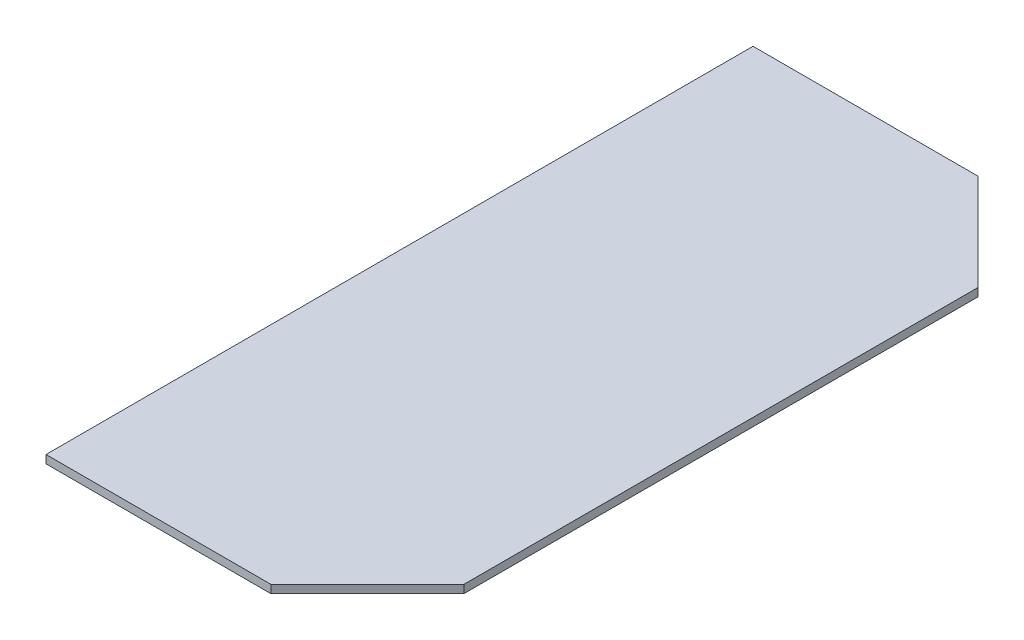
ISO-10303-21;
HEADER;
FILE_DESCRIPTION(('STEP AP214'),'2;1');
FILE_NAME('part.step','',(''),(''),'','','');
FILE_SCHEMA(('AUTOMOTIVE_DESIGN { 1 0 10303 214 1 1 1 1 }'));
ENDSEC;
DATA;
#1=APPLICATION_CONTEXT('core data for automotive mechanical design processes');
#2=APPLICATION_PROTOCOL_DEFINITION('international standard','automotive_design',2000,#1);
#3=PRODUCT_CONTEXT('',#1,'mechanical');
#4=PRODUCT('Part','Part','',(#3));
#5=PRODUCT_RELATED_PRODUCT_CATEGORY('part','',(#4));
#6=PRODUCT_DEFINITION_FORMATION('','',#4);
#7=PRODUCT_DEFINITION_CONTEXT('part definition',#1,'design');
#8=PRODUCT_DEFINITION('design','',#6,#7);
#9=PRODUCT_DEFINITION_SHAPE('','',#8);
#10=(LENGTH_UNIT() NAMED_UNIT(*) SI_UNIT(.MILLI.,.METRE.));
#11=(NAMED_UNIT(*) PLANE_ANGLE_UNIT() SI_UNIT($,.RADIAN.));
#12=(NAMED_UNIT(*) SI_UNIT($,.STERADIAN.) SOLID_ANGLE_UNIT());
#13=UNCERTAINTY_MEASURE_WITH_UNIT(LENGTH_MEASURE(1.E-05),#10,'distance_accuracy_value','');
#14=(GEOMETRIC_REPRESENTATION_CONTEXT(3) GLOBAL_UNCERTAINTY_ASSIGNED_CONTEXT((#13)) GLOBAL_UNIT_ASSIGNED_CONTEXT((#10,
#11,#12)) REPRESENTATION_CONTEXT('',''));
#15=CARTESIAN_POINT('',(0.,0.,0.));
#16=DIRECTION('',(0.,0.,1.));
#17=DIRECTION('',(1.,0.,0.));
#18=AXIS2_PLACEMENT_3D('',#15,#16,#17);
#19=CARTESIAN_POINT('',(0.,1.6002,-69.85));
#20=DIRECTION('',(0.,0.,1.));
#21=DIRECTION('',(1.,0.,0.));
#22=AXIS2_PLACEMENT_3D('',#19,#20,#21);
#23=PLANE('',#22);
#24=DIRECTION('',(-1.,0.,0.));
#25=VECTOR('',#24,1.);
#26=CARTESIAN_POINT('',(0.,0.,-69.85));
#27=LINE('',#26,#25);
#28=CARTESIAN_POINT('',(44.45,0.,-69.85));
#29=VERTEX_POINT('',#28);
#30=CARTESIAN_POINT('',(0.,0.,-69.85));
#31=VERTEX_POINT('',#30);
#32=EDGE_CURVE('E117',#29,#31,#27,.T.);
#33=ORIENTED_EDGE('',*,*,#32,.T.);
#34=DIRECTION('',(0.,-1.,0.));
#35=VECTOR('',#34,1.);
#36=CARTESIAN_POINT('',(0.,1.6002,-69.85));
#37=LINE('',#36,#35);
#38=CARTESIAN_POINT('',(0.,1.6002,-69.85));
#39=VERTEX_POINT('',#38);
#40=EDGE_CURVE('E11',#39,#31,#37,.T.);
#41=ORIENTED_EDGE('',*,*,#40,.F.);
#42=DIRECTION('',(-1.,0.,0.));
#43=VECTOR('',#42,1.);
#44=CARTESIAN_POINT('',(0.,1.6002,-69.85));
#45=LINE('',#44,#43);
#46=CARTESIAN_POINT('',(44.45,1.6002,-69.85));
#47=VERTEX_POINT('',#46);
#48=EDGE_CURVE('E127',#47,#39,#45,.T.);
#49=ORIENTED_EDGE('',*,*,#48,.F.);
#50=DIRECTION('',(0.,-1.,0.));
#51=VECTOR('',#50,1.);
#52=CARTESIAN_POINT('',(44.45,1.6002,-69.85));
#53=LINE('',#52,#51);
#54=EDGE_CURVE('E113',#47,#29,#53,.T.);
#55=ORIENTED_EDGE('',*,*,#54,.T.);
#56=EDGE_LOOP('',(#33,#41,#49,#55));
#57=FACE_BOUND('',#56,.T.);
#58=ADVANCED_FACE('F33',(#57),#23,.F.);
#59=CARTESIAN_POINT('',(0.,1.6002,-69.85));
#60=DIRECTION('',(1.,0.,0.));
#61=DIRECTION('',(0.,0.,-1.));
#62=AXIS2_PLACEMENT_3D('',#59,#60,#61);
#63=PLANE('',#62);
#64=DIRECTION('',(0.,0.,1.));
#65=VECTOR('',#64,1.);
#66=CARTESIAN_POINT('',(0.,0.,-69.85));
#67=LINE('',#66,#65);
#68=CARTESIAN_POINT('',(0.,0.,69.85));
#69=VERTEX_POINT('',#68);
#70=EDGE_CURVE('E120',#31,#69,#67,.T.);
#71=ORIENTED_EDGE('',*,*,#70,.T.);
#72=DIRECTION('',(0.,-1.,0.));
#73=VECTOR('',#72,1.);
#74=CARTESIAN_POINT('',(0.,1.6002,69.85));
#75=LINE('',#74,#73);
#76=CARTESIAN_POINT('',(0.,1.6002,69.85));
#77=VERTEX_POINT('',#76);
#78=EDGE_CURVE('E41',#77,#69,#75,.T.);
#79=ORIENTED_EDGE('',*,*,#78,.F.);
#80=DIRECTION('',(0.,0.,1.));
#81=VECTOR('',#80,1.);
#82=CARTESIAN_POINT('',(0.,1.6002,-69.85));
#83=LINE('',#82,#81);
#84=EDGE_CURVE('E86',#39,#77,#83,.T.);
#85=ORIENTED_EDGE('',*,*,#84,.F.);
#86=ORIENTED_EDGE('',*,*,#40,.T.);
#87=EDGE_LOOP('',(#71,#79,#85,#86));
#88=FACE_BOUND('',#87,.T.);
#89=ADVANCED_FACE('F151',(#88),#63,.F.);
#90=CARTESIAN_POINT('',(0.,1.6002,69.85));
#91=DIRECTION('',(0.,0.,-1.));
#92=DIRECTION('',(-1.,0.,0.));
#93=AXIS2_PLACEMENT_3D('',#90,#91,#92);
#94=PLANE('',#93);
#95=DIRECTION('',(1.,0.,0.));
#96=VECTOR('',#95,1.);
#97=CARTESIAN_POINT('',(0.,0.,69.85));
#98=LINE('',#97,#96);
#99=CARTESIAN_POINT('',(44.45,0.,69.85));
#100=VERTEX_POINT('',#99);
#101=EDGE_CURVE('E122',#69,#100,#98,.T.);
#102=ORIENTED_EDGE('',*,*,#101,.T.);
#103=DIRECTION('',(0.,-1.,0.));
#104=VECTOR('',#103,1.);
#105=CARTESIAN_POINT('',(44.45,1.6002,69.85));
#106=LINE('',#105,#104);
#107=CARTESIAN_POINT('',(44.45,1.6002,69.85));
#108=VERTEX_POINT('',#107);
#109=EDGE_CURVE('E108',#108,#100,#106,.T.);
#110=ORIENTED_EDGE('',*,*,#109,.F.);
#111=DIRECTION('',(1.,0.,0.));
#112=VECTOR('',#111,1.);
#113=CARTESIAN_POINT('',(0.,1.6002,69.85));
#114=LINE('',#113,#112);
#115=EDGE_CURVE('E99',#77,#108,#114,.T.);
#116=ORIENTED_EDGE('',*,*,#115,.F.);
#117=ORIENTED_EDGE('',*,*,#78,.T.);
#118=EDGE_LOOP('',(#102,#110,#116,#117));
#119=FACE_BOUND('',#118,.T.);
#120=ADVANCED_FACE('F133',(#119),#94,.F.);
#121=CARTESIAN_POINT('',(44.45,1.6002,69.85));
#122=DIRECTION('',(-0.707106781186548,0.,-0.707106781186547));
#123=DIRECTION('',(-0.707106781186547,0.,0.707106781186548));
#124=AXIS2_PLACEMENT_3D('',#121,#122,#123);
#125=PLANE('',#124);
#126=DIRECTION('',(0.707106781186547,0.,-0.707106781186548));
#127=VECTOR('',#126,1.);
#128=CARTESIAN_POINT('',(44.45,0.,69.85));
#129=LINE('',#128,#127);
#130=CARTESIAN_POINT('',(63.5,0.,50.8));
#131=VERTEX_POINT('',#130);
#132=EDGE_CURVE('E107',#100,#131,#129,.T.);
#133=ORIENTED_EDGE('',*,*,#132,.T.);
#134=DIRECTION('',(0.,-1.,0.));
#135=VECTOR('',#134,1.);
#136=CARTESIAN_POINT('',(63.5,1.6002,50.8));
#137=LINE('',#136,#135);
#138=CARTESIAN_POINT('',(63.5,1.6002,50.8));
#139=VERTEX_POINT('',#138);
#140=EDGE_CURVE('E104',#139,#131,#137,.T.);
#141=ORIENTED_EDGE('',*,*,#140,.F.);
#142=DIRECTION('',(0.707106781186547,0.,-0.707106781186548));
#143=VECTOR('',#142,1.);
#144=CARTESIAN_POINT('',(44.45,1.6002,69.85));
#145=LINE('',#144,#143);
#146=EDGE_CURVE('E93',#108,#139,#145,.T.);
#147=ORIENTED_EDGE('',*,*,#146,.F.);
#148=ORIENTED_EDGE('',*,*,#109,.T.);
#149=EDGE_LOOP('',(#133,#141,#147,#148));
#150=FACE_BOUND('',#149,.T.);
#151=ADVANCED_FACE('F105',(#150),#125,.F.);
#152=CARTESIAN_POINT('',(63.5,1.6002,-50.8));
#153=DIRECTION('',(-1.,0.,0.));
#154=DIRECTION('',(0.,0.,1.));
#155=AXIS2_PLACEMENT_3D('',#152,#153,#154);
#156=PLANE('',#155);
#157=DIRECTION('',(0.,0.,-1.));
#158=VECTOR('',#157,1.);
#159=CARTESIAN_POINT('',(63.5,0.,-50.8));
#160=LINE('',#159,#158);
#161=CARTESIAN_POINT('',(63.5,0.,-50.8));
#162=VERTEX_POINT('',#161);
#163=EDGE_CURVE('E72',#131,#162,#160,.T.);
#164=ORIENTED_EDGE('',*,*,#163,.T.);
#165=DIRECTION('',(0.,-1.,0.));
#166=VECTOR('',#165,1.);
#167=CARTESIAN_POINT('',(63.5,1.6002,-50.8));
#168=LINE('',#167,#166);
#169=CARTESIAN_POINT('',(63.5,1.6002,-50.8));
#170=VERTEX_POINT('',#169);
#171=EDGE_CURVE('E109',#170,#162,#168,.T.);
#172=ORIENTED_EDGE('',*,*,#171,.F.);
#173=DIRECTION('',(0.,0.,-1.));
#174=VECTOR('',#173,1.);
#175=CARTESIAN_POINT('',(63.5,1.6002,-50.8));
#176=LINE('',#175,#174);
#177=EDGE_CURVE('E97',#139,#170,#176,.T.);
#178=ORIENTED_EDGE('',*,*,#177,.F.);
#179=ORIENTED_EDGE('',*,*,#140,.T.);
#180=EDGE_LOOP('',(#164,#172,#178,#179));
#181=FACE_BOUND('',#180,.T.);
#182=ADVANCED_FACE('F111',(#181),#156,.F.);
#183=CARTESIAN_POINT('',(44.45,1.6002,-69.85));
#184=DIRECTION('',(-0.707106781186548,0.,0.707106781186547));
#185=DIRECTION('',(0.707106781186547,0.,0.707106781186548));
#186=AXIS2_PLACEMENT_3D('',#183,#184,#185);
#187=PLANE('',#186);
#188=DIRECTION('',(-0.707106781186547,0.,-0.707106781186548));
#189=VECTOR('',#188,1.);
#190=CARTESIAN_POINT('',(44.45,0.,-69.85));
#191=LINE('',#190,#189);
#192=EDGE_CURVE('E78',#162,#29,#191,.T.);
#193=ORIENTED_EDGE('',*,*,#192,.T.);
#194=ORIENTED_EDGE('',*,*,#54,.F.);
#195=DIRECTION('',(-0.707106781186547,0.,-0.707106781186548));
#196=VECTOR('',#195,1.);
#197=CARTESIAN_POINT('',(44.45,1.6002,-69.85));
#198=LINE('',#197,#196);
#199=EDGE_CURVE('E49',#170,#47,#198,.T.);
#200=ORIENTED_EDGE('',*,*,#199,.F.);
#201=ORIENTED_EDGE('',*,*,#171,.T.);
#202=EDGE_LOOP('',(#193,#194,#200,#201));
#203=FACE_BOUND('',#202,.T.);
#204=ADVANCED_FACE('F140',(#203),#187,.F.);
#205=CARTESIAN_POINT('',(0.,1.6002,0.));
#206=DIRECTION('',(0.,-1.,0.));
#207=DIRECTION('',(0.,0.,-1.));
#208=AXIS2_PLACEMENT_3D('',#205,#206,#207);
#209=PLANE('',#208);
#210=ORIENTED_EDGE('',*,*,#48,.T.);
#211=ORIENTED_EDGE('',*,*,#84,.T.);
#212=ORIENTED_EDGE('',*,*,#115,.T.);
#213=ORIENTED_EDGE('',*,*,#146,.T.);
#214=ORIENTED_EDGE('',*,*,#177,.T.);
#215=ORIENTED_EDGE('',*,*,#199,.T.);
#216=EDGE_LOOP('',(#210,#211,#212,#213,#214,#215));
#217=FACE_BOUND('',#216,.T.);
#218=ADVANCED_FACE('F95',(#217),#209,.F.);
#219=CARTESIAN_POINT('',(0.,0.,0.));
#220=DIRECTION('',(0.,-1.,0.));
#221=DIRECTION('',(0.,0.,-1.));
#222=AXIS2_PLACEMENT_3D('',#219,#220,#221);
#223=PLANE('',#222);
#224=ORIENTED_EDGE('',*,*,#32,.F.);
#225=ORIENTED_EDGE('',*,*,#192,.F.);
#226=ORIENTED_EDGE('',*,*,#163,.F.);
#227=ORIENTED_EDGE('',*,*,#132,.F.);
#228=ORIENTED_EDGE('',*,*,#101,.F.);
#229=ORIENTED_EDGE('',*,*,#70,.F.);
#230=EDGE_LOOP('',(#224,#225,#226,#227,#228,#229));
#231=FACE_BOUND('',#230,.T.);
#232=ADVANCED_FACE('F136',(#231),#223,.T.);
#233=CLOSED_SHELL('',(#58,#89,#120,#151,#182,#204,#218,#232));
#234=MANIFOLD_SOLID_BREP('B2',#233);
#235=ADVANCED_BREP_SHAPE_REPRESENTATION('',(#18,#234),#14);
#236=SHAPE_DEFINITION_REPRESENTATION(#9,#235);
ENDSEC;
END-ISO-10303-21;
